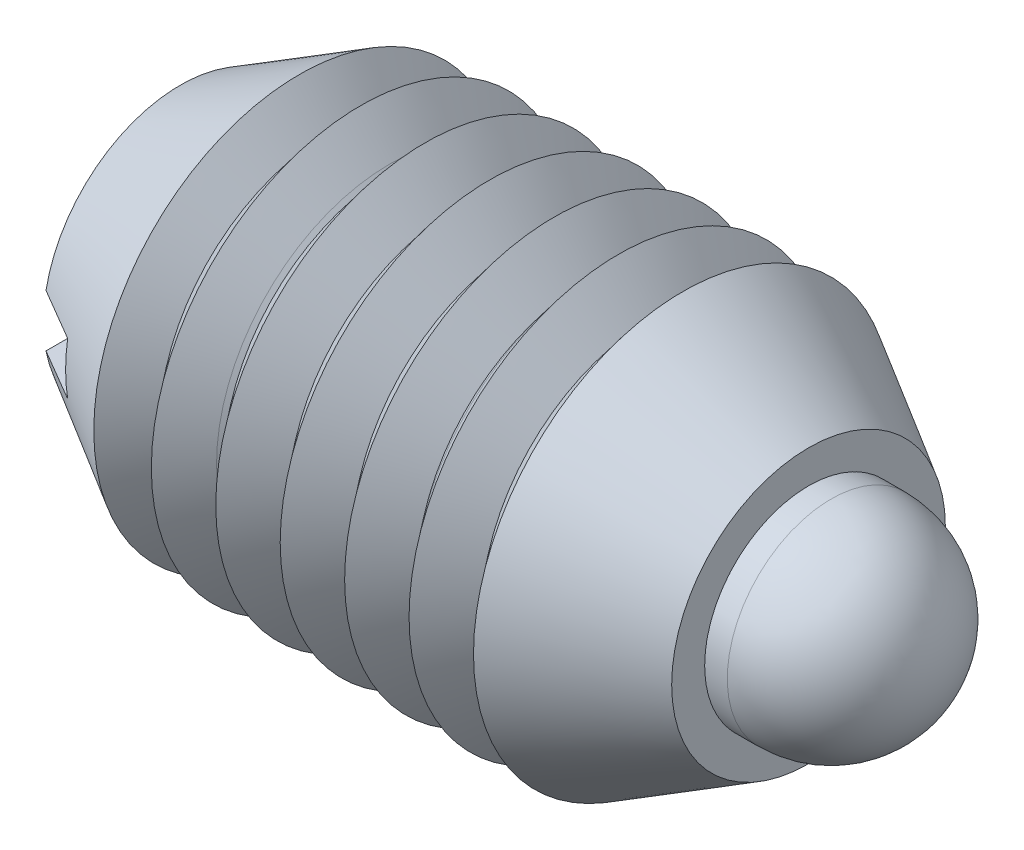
ISO-10303-21;
HEADER;
FILE_DESCRIPTION(('STEP AP214'),'2;1');
FILE_NAME('part.step','',(''),(''),'','','');
FILE_SCHEMA(('AUTOMOTIVE_DESIGN { 1 0 10303 214 1 1 1 1 }'));
ENDSEC;
DATA;
#1=APPLICATION_CONTEXT('core data for automotive mechanical design processes');
#2=APPLICATION_PROTOCOL_DEFINITION('international standard','automotive_design',2000,#1);
#3=PRODUCT_CONTEXT('',#1,'mechanical');
#4=PRODUCT('Part','Part','',(#3));
#5=PRODUCT_RELATED_PRODUCT_CATEGORY('part','',(#4));
#6=PRODUCT_DEFINITION_FORMATION('','',#4);
#7=PRODUCT_DEFINITION_CONTEXT('part definition',#1,'design');
#8=PRODUCT_DEFINITION('design','',#6,#7);
#9=PRODUCT_DEFINITION_SHAPE('','',#8);
#10=(LENGTH_UNIT() NAMED_UNIT(*) SI_UNIT(.MILLI.,.METRE.));
#11=(NAMED_UNIT(*) PLANE_ANGLE_UNIT() SI_UNIT($,.RADIAN.));
#12=(NAMED_UNIT(*) SI_UNIT($,.STERADIAN.) SOLID_ANGLE_UNIT());
#13=UNCERTAINTY_MEASURE_WITH_UNIT(LENGTH_MEASURE(1.E-05),#10,'distance_accuracy_value','');
#14=(GEOMETRIC_REPRESENTATION_CONTEXT(3) GLOBAL_UNCERTAINTY_ASSIGNED_CONTEXT((#13)) GLOBAL_UNIT_ASSIGNED_CONTEXT((#10,
#11,#12)) REPRESENTATION_CONTEXT('',''));
#15=CARTESIAN_POINT('',(0.,0.,0.));
#16=DIRECTION('',(0.,0.,1.));
#17=DIRECTION('',(1.,0.,0.));
#18=AXIS2_PLACEMENT_3D('',#15,#16,#17);
#19=CARTESIAN_POINT('',(11.80592,0.,0.));
#20=DIRECTION('',(-1.,0.,0.));
#21=DIRECTION('',(0.,-0.719424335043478,-0.694570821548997));
#22=AXIS2_PLACEMENT_3D('',#19,#20,#21);
#23=PLANE('',#22);
#24=CARTESIAN_POINT('',(11.80592,0.,0.));
#25=DIRECTION('',(1.,0.,0.));
#26=DIRECTION('',(0.,0.719424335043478,0.694570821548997));
#27=AXIS2_PLACEMENT_3D('',#24,#25,#26);
#28=CIRCLE('',#27,3.1496);
#29=CARTESIAN_POINT('',(11.80592,2.26589888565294,2.18762025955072));
#30=VERTEX_POINT('',#29);
#31=EDGE_CURVE('P0_E10',#30,#30,#28,.T.);
#32=ORIENTED_EDGE('',*,*,#31,.F.);
#33=EDGE_LOOP('',(#32));
#34=FACE_BOUND('',#33,.T.);
#35=ADVANCED_FACE('P0_F14',(#34),#23,.T.);
#36=CARTESIAN_POINT('',(12.43584,0.,0.));
#37=DIRECTION('',(1.,0.,0.));
#38=DIRECTION('',(0.,0.719424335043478,0.694570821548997));
#39=AXIS2_PLACEMENT_3D('',#36,#37,#38);
#40=CONICAL_SURFACE('',#39,3.77952,0.785398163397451);
#41=ORIENTED_EDGE('',*,*,#31,.T.);
#42=EDGE_LOOP('',(#41));
#43=FACE_BOUND('',#42,.T.);
#44=CARTESIAN_POINT('',(12.43584,0.,0.));
#45=DIRECTION('',(1.,0.,0.));
#46=DIRECTION('',(0.,0.719424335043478,0.694570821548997));
#47=AXIS2_PLACEMENT_3D('',#44,#45,#46);
#48=CIRCLE('',#47,3.77952);
#49=CARTESIAN_POINT('',(12.43584,2.71907866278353,2.62514431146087));
#50=VERTEX_POINT('',#49);
#51=EDGE_CURVE('P0_E20',#50,#50,#48,.T.);
#52=ORIENTED_EDGE('',*,*,#51,.F.);
#53=EDGE_LOOP('',(#52));
#54=FACE_BOUND('',#53,.T.);
#55=ADVANCED_FACE('P0_F54',(#43,#54),#40,.T.);
#56=CARTESIAN_POINT('',(22.8854,0.,0.));
#57=DIRECTION('',(1.,0.,0.));
#58=DIRECTION('',(0.,0.719424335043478,0.694570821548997));
#59=AXIS2_PLACEMENT_3D('',#56,#57,#58);
#60=CYLINDRICAL_SURFACE('',#59,3.77952);
#61=ORIENTED_EDGE('',*,*,#51,.T.);
#62=EDGE_LOOP('',(#61));
#63=FACE_BOUND('',#62,.T.);
#64=CARTESIAN_POINT('',(17.0140665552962,0.,0.));
#65=DIRECTION('',(1.,0.,0.));
#66=DIRECTION('',(0.,0.719424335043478,0.694570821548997));
#67=AXIS2_PLACEMENT_3D('',#64,#65,#66);
#68=CIRCLE('',#67,3.77952);
#69=CARTESIAN_POINT('',(17.0140665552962,2.71907866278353,2.62514431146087));
#70=VERTEX_POINT('',#69);
#71=EDGE_CURVE('P0_E24',#70,#70,#68,.T.);
#72=ORIENTED_EDGE('',*,*,#71,.F.);
#73=EDGE_LOOP('',(#72));
#74=FACE_BOUND('',#73,.T.);
#75=ADVANCED_FACE('P0_F50',(#63,#74),#60,.T.);
#76=CARTESIAN_POINT('',(18.10512,0.,0.));
#77=DIRECTION('',(-1.,0.,0.));
#78=DIRECTION('',(0.,-0.719424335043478,-0.694570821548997));
#79=AXIS2_PLACEMENT_3D('',#76,#77,#78);
#80=CONICAL_SURFACE('',#79,3.1496,0.523598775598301);
#81=ORIENTED_EDGE('',*,*,#71,.T.);
#82=EDGE_LOOP('',(#81));
#83=FACE_BOUND('',#82,.T.);
#84=CARTESIAN_POINT('',(18.10512,0.,0.));
#85=DIRECTION('',(1.,0.,0.));
#86=DIRECTION('',(0.,0.719424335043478,0.694570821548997));
#87=AXIS2_PLACEMENT_3D('',#84,#85,#86);
#88=CIRCLE('',#87,3.1496);
#89=CARTESIAN_POINT('',(18.10512,2.26589888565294,2.18762025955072));
#90=VERTEX_POINT('',#89);
#91=EDGE_CURVE('P0_E28',#90,#90,#88,.T.);
#92=ORIENTED_EDGE('',*,*,#91,.F.);
#93=EDGE_LOOP('',(#92));
#94=FACE_BOUND('',#93,.T.);
#95=ADVANCED_FACE('P0_F41',(#83,#94),#80,.T.);
#96=CARTESIAN_POINT('',(22.8854,0.,0.));
#97=DIRECTION('',(1.,0.,0.));
#98=DIRECTION('',(0.,0.719424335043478,0.694570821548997));
#99=AXIS2_PLACEMENT_3D('',#96,#97,#98);
#100=CYLINDRICAL_SURFACE('',#99,3.1496);
#101=ORIENTED_EDGE('',*,*,#91,.T.);
#102=EDGE_LOOP('',(#101));
#103=FACE_BOUND('',#102,.T.);
#104=CARTESIAN_POINT('',(19.7358,0.,0.));
#105=DIRECTION('',(1.,0.,0.));
#106=DIRECTION('',(0.,0.719424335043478,0.694570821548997));
#107=AXIS2_PLACEMENT_3D('',#104,#105,#106);
#108=CIRCLE('',#107,3.1496);
#109=CARTESIAN_POINT('',(19.7358,2.26589888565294,2.18762025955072));
#110=VERTEX_POINT('',#109);
#111=EDGE_CURVE('P0_E33',#110,#110,#108,.T.);
#112=ORIENTED_EDGE('',*,*,#111,.F.);
#113=EDGE_LOOP('',(#112));
#114=FACE_BOUND('',#113,.T.);
#115=ADVANCED_FACE('P0_F39',(#103,#114),#100,.T.);
#116=CARTESIAN_POINT('',(19.7358,0.,0.));
#117=DIRECTION('',(1.,0.,0.));
#118=DIRECTION('',(0.,0.719424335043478,0.694570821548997));
#119=AXIS2_PLACEMENT_3D('',#116,#117,#118);
#120=SPHERICAL_SURFACE('',#119,3.1496);
#121=ORIENTED_EDGE('',*,*,#111,.T.);
#122=EDGE_LOOP('',(#121));
#123=FACE_BOUND('',#122,.T.);
#124=ADVANCED_FACE('P0_F37',(#123),#120,.T.);
#125=CLOSED_SHELL('',(#35,#55,#75,#95,#115,#124));
#126=MANIFOLD_SOLID_BREP('P0_B1',#125);
#127=CARTESIAN_POINT('',(6.35,12.7,-6.35));
#128=DIRECTION('',(-1.,0.,0.));
#129=DIRECTION('',(0.,-1.,0.));
#130=AXIS2_PLACEMENT_3D('',#127,#128,#129);
#131=PLANE('',#130);
#132=CARTESIAN_POINT('',(6.35,0.,0.));
#133=DIRECTION('',(-1.,0.,0.));
#134=DIRECTION('',(0.,-1.,0.));
#135=AXIS2_PLACEMENT_3D('',#132,#133,#134);
#136=CIRCLE('',#135,5.25184112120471);
#137=CARTESIAN_POINT('',(6.35,-5.25184112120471,0.));
#138=VERTEX_POINT('',#137);
#139=EDGE_CURVE('P1_E31',#138,#138,#136,.F.);
#140=ORIENTED_EDGE('',*,*,#139,.F.);
#141=EDGE_LOOP('',(#140));
#142=FACE_BOUND('',#141,.T.);
#143=CARTESIAN_POINT('',(6.35,0.,0.));
#144=DIRECTION('',(1.,0.,0.));
#145=DIRECTION('',(0.,0.,-1.));
#146=AXIS2_PLACEMENT_3D('',#143,#144,#145);
#147=CIRCLE('',#146,3.80492);
#148=CARTESIAN_POINT('',(6.35,0.,3.80492));
#149=VERTEX_POINT('',#148);
#150=EDGE_CURVE('P1_E47',#149,#149,#147,.T.);
#151=ORIENTED_EDGE('',*,*,#150,.T.);
#152=EDGE_LOOP('',(#151));
#153=FACE_BOUND('',#152,.T.);
#154=ADVANCED_FACE('P1_F14',(#142,#153),#131,.T.);
#155=CARTESIAN_POINT('',(12.7,12.7,-6.35));
#156=DIRECTION('',(1.,0.,0.));
#157=DIRECTION('',(0.,0.,-1.));
#158=AXIS2_PLACEMENT_3D('',#155,#156,#157);
#159=PLANE('',#158);
#160=CARTESIAN_POINT('',(12.7,0.,0.));
#161=DIRECTION('',(1.,0.,0.));
#162=DIRECTION('',(0.,0.,-1.));
#163=AXIS2_PLACEMENT_3D('',#160,#161,#162);
#164=CIRCLE('',#163,5.61789408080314);
#165=CARTESIAN_POINT('',(12.7,0.,-5.61789408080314));
#166=VERTEX_POINT('',#165);
#167=EDGE_CURVE('P1_E33',#166,#166,#164,.F.);
#168=ORIENTED_EDGE('',*,*,#167,.F.);
#169=EDGE_LOOP('',(#168));
#170=FACE_BOUND('',#169,.T.);
#171=CARTESIAN_POINT('',(12.7,0.,0.));
#172=DIRECTION('',(1.,0.,0.));
#173=DIRECTION('',(0.,0.,-1.));
#174=AXIS2_PLACEMENT_3D('',#171,#172,#173);
#175=CIRCLE('',#174,3.80492);
#176=CARTESIAN_POINT('',(12.7,0.,3.80492));
#177=VERTEX_POINT('',#176);
#178=EDGE_CURVE('P1_E18',#177,#177,#175,.F.);
#179=ORIENTED_EDGE('',*,*,#178,.T.);
#180=EDGE_LOOP('',(#179));
#181=FACE_BOUND('',#180,.T.);
#182=ADVANCED_FACE('P1_F71',(#170,#181),#159,.T.);
#183=CARTESIAN_POINT('',(8.40153846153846,0.,0.));
#184=DIRECTION('',(1.,0.,0.));
#185=DIRECTION('',(0.,0.,-1.));
#186=AXIS2_PLACEMENT_3D('',#183,#184,#185);
#187=CONICAL_SURFACE('',#186,5.12982346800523,0.895664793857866);
#188=CARTESIAN_POINT('',(9.37846153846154,0.,0.));
#189=DIRECTION('',(-1.,0.,0.));
#190=DIRECTION('',(0.,0.,1.));
#191=AXIS2_PLACEMENT_3D('',#188,#189,#190);
#192=CIRCLE('',#191,6.35);
#193=CARTESIAN_POINT('',(9.37846153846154,0.,6.35));
#194=VERTEX_POINT('',#193);
#195=EDGE_CURVE('P1_E44',#194,#194,#192,.T.);
#196=ORIENTED_EDGE('',*,*,#195,.T.);
#197=EDGE_LOOP('',(#196));
#198=FACE_BOUND('',#197,.T.);
#199=CARTESIAN_POINT('',(8.40153846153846,0.,0.));
#200=DIRECTION('',(-1.,0.,0.));
#201=DIRECTION('',(0.,0.,1.));
#202=AXIS2_PLACEMENT_3D('',#199,#200,#201);
#203=CIRCLE('',#202,5.12982346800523);
#204=CARTESIAN_POINT('',(8.40153846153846,0.,5.12982346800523));
#205=VERTEX_POINT('',#204);
#206=EDGE_CURVE('P1_E51',#205,#205,#203,.T.);
#207=ORIENTED_EDGE('',*,*,#206,.F.);
#208=EDGE_LOOP('',(#207));
#209=FACE_BOUND('',#208,.T.);
#210=ADVANCED_FACE('P1_F77',(#198,#209),#187,.T.);
#211=CARTESIAN_POINT('',(7.42461538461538,0.,0.));
#212=DIRECTION('',(-1.,0.,0.));
#213=DIRECTION('',(0.,0.,1.));
#214=AXIS2_PLACEMENT_3D('',#211,#212,#213);
#215=CONICAL_SURFACE('',#214,6.35,0.895664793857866);
#216=ORIENTED_EDGE('',*,*,#206,.T.);
#217=EDGE_LOOP('',(#216));
#218=FACE_BOUND('',#217,.T.);
#219=CARTESIAN_POINT('',(7.42461538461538,0.,0.));
#220=DIRECTION('',(-1.,0.,0.));
#221=DIRECTION('',(0.,0.,1.));
#222=AXIS2_PLACEMENT_3D('',#219,#220,#221);
#223=CIRCLE('',#222,6.35);
#224=CARTESIAN_POINT('',(7.42461538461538,0.,6.35));
#225=VERTEX_POINT('',#224);
#226=EDGE_CURVE('P1_E35',#225,#225,#223,.T.);
#227=ORIENTED_EDGE('',*,*,#226,.F.);
#228=EDGE_LOOP('',(#227));
#229=FACE_BOUND('',#228,.T.);
#230=ADVANCED_FACE('P1_F91',(#218,#229),#215,.T.);
#231=CARTESIAN_POINT('',(6.44769230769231,0.,0.));
#232=DIRECTION('',(1.,0.,0.));
#233=DIRECTION('',(0.,0.,-1.));
#234=AXIS2_PLACEMENT_3D('',#231,#232,#233);
#235=CONICAL_SURFACE('',#234,5.12982346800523,0.895664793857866);
#236=ORIENTED_EDGE('',*,*,#226,.T.);
#237=EDGE_LOOP('',(#236));
#238=FACE_BOUND('',#237,.T.);
#239=CARTESIAN_POINT('',(6.44769230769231,0.,0.));
#240=DIRECTION('',(-1.,0.,0.));
#241=DIRECTION('',(0.,0.,1.));
#242=AXIS2_PLACEMENT_3D('',#239,#240,#241);
#243=CIRCLE('',#242,5.12982346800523);
#244=CARTESIAN_POINT('',(6.44769230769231,0.,5.12982346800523));
#245=VERTEX_POINT('',#244);
#246=EDGE_CURVE('P1_E39',#245,#245,#243,.T.);
#247=ORIENTED_EDGE('',*,*,#246,.F.);
#248=EDGE_LOOP('',(#247));
#249=FACE_BOUND('',#248,.T.);
#250=ADVANCED_FACE('P1_F87',(#238,#249),#235,.T.);
#251=CARTESIAN_POINT('',(5.47076923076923,0.,0.));
#252=DIRECTION('',(-1.,0.,0.));
#253=DIRECTION('',(0.,0.,1.));
#254=AXIS2_PLACEMENT_3D('',#251,#252,#253);
#255=CONICAL_SURFACE('',#254,6.35,0.895664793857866);
#256=ORIENTED_EDGE('',*,*,#246,.T.);
#257=EDGE_LOOP('',(#256));
#258=FACE_BOUND('',#257,.T.);
#259=ORIENTED_EDGE('',*,*,#139,.T.);
#260=EDGE_LOOP('',(#259));
#261=FACE_BOUND('',#260,.T.);
#262=ADVANCED_FACE('P1_F84',(#258,#261),#255,.T.);
#263=CARTESIAN_POINT('',(9.37846153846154,0.,0.));
#264=DIRECTION('',(-1.,0.,0.));
#265=DIRECTION('',(0.,0.,1.));
#266=AXIS2_PLACEMENT_3D('',#263,#264,#265);
#267=CONICAL_SURFACE('',#266,6.35,0.895664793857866);
#268=CARTESIAN_POINT('',(10.3553846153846,0.,0.));
#269=DIRECTION('',(-1.,0.,0.));
#270=DIRECTION('',(0.,0.,1.));
#271=AXIS2_PLACEMENT_3D('',#268,#269,#270);
#272=CIRCLE('',#271,5.12982346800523);
#273=CARTESIAN_POINT('',(10.3553846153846,0.,5.12982346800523));
#274=VERTEX_POINT('',#273);
#275=EDGE_CURVE('P1_E22',#274,#274,#272,.T.);
#276=ORIENTED_EDGE('',*,*,#275,.T.);
#277=EDGE_LOOP('',(#276));
#278=FACE_BOUND('',#277,.T.);
#279=ORIENTED_EDGE('',*,*,#195,.F.);
#280=EDGE_LOOP('',(#279));
#281=FACE_BOUND('',#280,.T.);
#282=ADVANCED_FACE('P1_F68',(#278,#281),#267,.T.);
#283=CARTESIAN_POINT('',(10.3553846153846,0.,0.));
#284=DIRECTION('',(1.,0.,0.));
#285=DIRECTION('',(0.,0.,-1.));
#286=AXIS2_PLACEMENT_3D('',#283,#284,#285);
#287=CONICAL_SURFACE('',#286,5.12982346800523,0.895664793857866);
#288=CARTESIAN_POINT('',(11.3323076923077,0.,0.));
#289=DIRECTION('',(-1.,0.,0.));
#290=DIRECTION('',(0.,0.,1.));
#291=AXIS2_PLACEMENT_3D('',#288,#289,#290);
#292=CIRCLE('',#291,6.35);
#293=CARTESIAN_POINT('',(11.3323076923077,0.,6.35));
#294=VERTEX_POINT('',#293);
#295=EDGE_CURVE('P1_E27',#294,#294,#292,.T.);
#296=ORIENTED_EDGE('',*,*,#295,.T.);
#297=EDGE_LOOP('',(#296));
#298=FACE_BOUND('',#297,.T.);
#299=ORIENTED_EDGE('',*,*,#275,.F.);
#300=EDGE_LOOP('',(#299));
#301=FACE_BOUND('',#300,.T.);
#302=ADVANCED_FACE('P1_F56',(#298,#301),#287,.T.);
#303=CARTESIAN_POINT('',(11.3323076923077,0.,0.));
#304=DIRECTION('',(-1.,0.,0.));
#305=DIRECTION('',(0.,0.,1.));
#306=AXIS2_PLACEMENT_3D('',#303,#304,#305);
#307=CONICAL_SURFACE('',#306,6.35,0.895664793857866);
#308=CARTESIAN_POINT('',(12.3092307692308,0.,0.));
#309=DIRECTION('',(-1.,0.,0.));
#310=DIRECTION('',(0.,0.,1.));
#311=AXIS2_PLACEMENT_3D('',#308,#309,#310);
#312=CIRCLE('',#311,5.12982346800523);
#313=CARTESIAN_POINT('',(12.3092307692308,0.,5.12982346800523));
#314=VERTEX_POINT('',#313);
#315=EDGE_CURVE('P1_E10',#314,#314,#312,.T.);
#316=ORIENTED_EDGE('',*,*,#315,.T.);
#317=EDGE_LOOP('',(#316));
#318=FACE_BOUND('',#317,.T.);
#319=ORIENTED_EDGE('',*,*,#295,.F.);
#320=EDGE_LOOP('',(#319));
#321=FACE_BOUND('',#320,.T.);
#322=ADVANCED_FACE('P1_F59',(#318,#321),#307,.T.);
#323=CARTESIAN_POINT('',(12.3092307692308,0.,0.));
#324=DIRECTION('',(1.,0.,0.));
#325=DIRECTION('',(0.,0.,-1.));
#326=AXIS2_PLACEMENT_3D('',#323,#324,#325);
#327=CONICAL_SURFACE('',#326,5.12982346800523,0.895664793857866);
#328=ORIENTED_EDGE('',*,*,#315,.F.);
#329=EDGE_LOOP('',(#328));
#330=FACE_BOUND('',#329,.T.);
#331=ORIENTED_EDGE('',*,*,#167,.T.);
#332=EDGE_LOOP('',(#331));
#333=FACE_BOUND('',#332,.T.);
#334=ADVANCED_FACE('P1_F16',(#330,#333),#327,.T.);
#335=CARTESIAN_POINT('',(19.05,0.,0.));
#336=DIRECTION('',(-1.,0.,0.));
#337=DIRECTION('',(0.,0.,1.));
#338=AXIS2_PLACEMENT_3D('',#335,#336,#337);
#339=CYLINDRICAL_SURFACE('',#338,3.80492);
#340=CARTESIAN_POINT('',(12.7,0.,3.80492));
#341=CARTESIAN_POINT('',(12.6338541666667,0.,3.80492));
#342=CARTESIAN_POINT('',(12.5677083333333,0.,3.80492));
#343=CARTESIAN_POINT('',(12.4354166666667,0.,3.80492));
#344=CARTESIAN_POINT('',(12.3692708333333,0.,3.80492));
#345=CARTESIAN_POINT('',(12.2369791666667,0.,3.80492));
#346=CARTESIAN_POINT('',(12.1708333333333,0.,3.80492));
#347=CARTESIAN_POINT('',(12.0385416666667,0.,3.80492));
#348=CARTESIAN_POINT('',(11.9723958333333,0.,3.80492));
#349=CARTESIAN_POINT('',(11.8401041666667,0.,3.80492));
#350=CARTESIAN_POINT('',(11.7739583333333,0.,3.80492));
#351=CARTESIAN_POINT('',(11.6416666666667,0.,3.80492));
#352=CARTESIAN_POINT('',(11.5755208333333,0.,3.80492));
#353=CARTESIAN_POINT('',(11.4432291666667,0.,3.80492));
#354=CARTESIAN_POINT('',(11.3770833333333,0.,3.80492));
#355=CARTESIAN_POINT('',(11.2447916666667,0.,3.80492));
#356=CARTESIAN_POINT('',(11.1786458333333,0.,3.80492));
#357=CARTESIAN_POINT('',(11.0463541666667,0.,3.80492));
#358=CARTESIAN_POINT('',(10.9802083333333,0.,3.80492));
#359=CARTESIAN_POINT('',(10.8479166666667,0.,3.80492));
#360=CARTESIAN_POINT('',(10.7817708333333,0.,3.80492));
#361=CARTESIAN_POINT('',(10.6494791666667,0.,3.80492));
#362=CARTESIAN_POINT('',(10.5833333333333,0.,3.80492));
#363=CARTESIAN_POINT('',(10.4510416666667,0.,3.80492));
#364=CARTESIAN_POINT('',(10.3848958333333,0.,3.80492));
#365=CARTESIAN_POINT('',(10.2526041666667,0.,3.80492));
#366=CARTESIAN_POINT('',(10.1864583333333,0.,3.80492));
#367=CARTESIAN_POINT('',(10.0541666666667,0.,3.80492));
#368=CARTESIAN_POINT('',(9.98802083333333,0.,3.80492));
#369=CARTESIAN_POINT('',(9.85572916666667,0.,3.80492));
#370=CARTESIAN_POINT('',(9.78958333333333,0.,3.80492));
#371=CARTESIAN_POINT('',(9.65729166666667,0.,3.80492));
#372=CARTESIAN_POINT('',(9.59114583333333,0.,3.80492));
#373=CARTESIAN_POINT('',(9.45885416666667,0.,3.80492));
#374=CARTESIAN_POINT('',(9.39270833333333,0.,3.80492));
#375=CARTESIAN_POINT('',(9.26041666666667,0.,3.80492));
#376=CARTESIAN_POINT('',(9.19427083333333,0.,3.80492));
#377=CARTESIAN_POINT('',(9.06197916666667,0.,3.80492));
#378=CARTESIAN_POINT('',(8.99583333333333,0.,3.80492));
#379=CARTESIAN_POINT('',(8.86354166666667,0.,3.80492));
#380=CARTESIAN_POINT('',(8.79739583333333,0.,3.80492));
#381=CARTESIAN_POINT('',(8.66510416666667,0.,3.80492));
#382=CARTESIAN_POINT('',(8.59895833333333,0.,3.80492));
#383=CARTESIAN_POINT('',(8.46666666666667,0.,3.80492));
#384=CARTESIAN_POINT('',(8.40052083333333,0.,3.80492));
#385=CARTESIAN_POINT('',(8.26822916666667,0.,3.80492));
#386=CARTESIAN_POINT('',(8.20208333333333,0.,3.80492));
#387=CARTESIAN_POINT('',(8.06979166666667,0.,3.80492));
#388=CARTESIAN_POINT('',(8.00364583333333,0.,3.80492));
#389=CARTESIAN_POINT('',(7.87135416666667,0.,3.80492));
#390=CARTESIAN_POINT('',(7.80520833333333,0.,3.80492));
#391=CARTESIAN_POINT('',(7.67291666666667,0.,3.80492));
#392=CARTESIAN_POINT('',(7.60677083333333,0.,3.80492));
#393=CARTESIAN_POINT('',(7.47447916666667,0.,3.80492));
#394=CARTESIAN_POINT('',(7.40833333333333,0.,3.80492));
#395=CARTESIAN_POINT('',(7.27604166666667,0.,3.80492));
#396=CARTESIAN_POINT('',(7.20989583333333,0.,3.80492));
#397=CARTESIAN_POINT('',(7.07760416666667,0.,3.80492));
#398=CARTESIAN_POINT('',(7.01145833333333,0.,3.80492));
#399=CARTESIAN_POINT('',(6.87916666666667,0.,3.80492));
#400=CARTESIAN_POINT('',(6.81302083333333,0.,3.80492));
#401=CARTESIAN_POINT('',(6.68072916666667,0.,3.80492));
#402=CARTESIAN_POINT('',(6.61458333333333,0.,3.80492));
#403=CARTESIAN_POINT('',(6.48229166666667,0.,3.80492));
#404=CARTESIAN_POINT('',(6.41614583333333,0.,3.80492));
#405=CARTESIAN_POINT('',(6.35,0.,3.80492));
#406=B_SPLINE_CURVE_WITH_KNOTS('',3,(#340,#341,#342,#343,#344,#345,#346,#347,#348,#349,#350,
#351,#352,#353,#354,#355,#356,#357,#358,#359,#360,#361,#362,#363,#364,#365,#366,#367,#368,#369,
#370,#371,#372,#373,#374,#375,#376,#377,#378,#379,#380,#381,#382,#383,#384,#385,#386,#387,#388,
#389,#390,#391,#392,#393,#394,#395,#396,#397,#398,#399,#400,#401,#402,#403,#404,#405),
.UNSPECIFIED.,.F.,.F.,(4,2,2,2,2,2,2,2,2,2,2,2,2,2,2,2,2,2,2,2,2,2,2,2,2,2,2,2,2,2,2,2,4),(0.,
0.198437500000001,0.396875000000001,0.5953125,0.793750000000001,0.992187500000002,1.190625,
1.3890625,1.5875,1.7859375,1.984375,2.1828125,2.38125,2.5796875,2.778125,2.9765625,3.175,
3.3734375,3.571875,3.7703125,3.96875,4.1671875,4.365625,4.5640625,4.7625,4.9609375,5.159375,
5.3578125,5.55625,5.7546875,5.953125,6.1515625,6.35),.UNSPECIFIED.);
#407=EDGE_CURVE('P1_BSEAM66',#177,#149,#406,.T.);
#408=ORIENTED_EDGE('',*,*,#178,.F.);
#409=ORIENTED_EDGE('',*,*,#150,.F.);
#410=ORIENTED_EDGE('',*,*,#407,.T.);
#411=ORIENTED_EDGE('',*,*,#407,.F.);
#412=EDGE_LOOP('',(#408,#410,#409,#411));
#413=FACE_BOUND('',#412,.T.);
#414=ADVANCED_FACE('P1_F66',(#413),#339,.F.);
#415=CLOSED_SHELL('',(#154,#182,#210,#230,#250,#262,#282,#302,#322,#334,#414));
#416=MANIFOLD_SOLID_BREP('P1_B1',#415);
#417=CARTESIAN_POINT('',(19.05,0.,0.));
#418=DIRECTION('',(1.,0.,0.));
#419=DIRECTION('',(0.,0.,-1.));
#420=AXIS2_PLACEMENT_3D('',#417,#418,#419);
#421=PLANE('',#420);
#422=CARTESIAN_POINT('',(19.05,0.,0.));
#423=DIRECTION('',(1.,0.,0.));
#424=DIRECTION('',(0.,0.,-1.));
#425=AXIS2_PLACEMENT_3D('',#422,#423,#424);
#426=CIRCLE('',#425,4.15029547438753);
#427=CARTESIAN_POINT('',(19.05,0.,-4.15029547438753));
#428=VERTEX_POINT('',#427);
#429=EDGE_CURVE('P2_E79',#428,#428,#426,.T.);
#430=ORIENTED_EDGE('',*,*,#429,.T.);
#431=EDGE_LOOP('',(#430));
#432=FACE_BOUND('',#431,.T.);
#433=CARTESIAN_POINT('',(19.05,0.,0.));
#434=DIRECTION('',(-1.,0.,0.));
#435=DIRECTION('',(0.,0.,1.));
#436=AXIS2_PLACEMENT_3D('',#433,#434,#435);
#437=CIRCLE('',#436,3.1496);
#438=CARTESIAN_POINT('',(19.05,0.,3.1496));
#439=VERTEX_POINT('',#438);
#440=EDGE_CURVE('P2_E66',#439,#439,#437,.T.);
#441=ORIENTED_EDGE('',*,*,#440,.T.);
#442=EDGE_LOOP('',(#441));
#443=FACE_BOUND('',#442,.T.);
#444=ADVANCED_FACE('P2_F15',(#432,#443),#421,.T.);
#445=CARTESIAN_POINT('',(19.05,0.,0.));
#446=DIRECTION('',(-1.,0.,0.));
#447=DIRECTION('',(0.,0.,1.));
#448=AXIS2_PLACEMENT_3D('',#445,#446,#447);
#449=CONICAL_SURFACE('',#448,4.15029547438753,0.523598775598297);
#450=CARTESIAN_POINT('',(15.24,0.,0.));
#451=DIRECTION('',(-1.,0.,0.));
#452=DIRECTION('',(0.,0.,1.));
#453=AXIS2_PLACEMENT_3D('',#450,#451,#452);
#454=CIRCLE('',#453,6.35);
#455=CARTESIAN_POINT('',(15.24,0.,6.35));
#456=VERTEX_POINT('',#455);
#457=EDGE_CURVE('P2_E135',#456,#456,#454,.T.);
#458=ORIENTED_EDGE('',*,*,#457,.F.);
#459=EDGE_LOOP('',(#458));
#460=FACE_BOUND('',#459,.T.);
#461=ORIENTED_EDGE('',*,*,#429,.F.);
#462=EDGE_LOOP('',(#461));
#463=FACE_BOUND('',#462,.T.);
#464=ADVANCED_FACE('P2_F17',(#460,#463),#449,.T.);
#465=CARTESIAN_POINT('',(0.,0.,0.));
#466=DIRECTION('',(-1.,0.,0.));
#467=DIRECTION('',(0.,0.,1.));
#468=AXIS2_PLACEMENT_3D('',#465,#466,#467);
#469=CYLINDRICAL_SURFACE('',#468,3.1496);
#470=CARTESIAN_POINT('',(18.10512,0.,0.));
#471=DIRECTION('',(-1.,0.,0.));
#472=DIRECTION('',(0.,0.,1.));
#473=AXIS2_PLACEMENT_3D('',#470,#471,#472);
#474=CIRCLE('',#473,3.1496);
#475=CARTESIAN_POINT('',(18.10512,0.,3.1496));
#476=VERTEX_POINT('',#475);
#477=EDGE_CURVE('P2_E147',#476,#476,#474,.T.);
#478=ORIENTED_EDGE('',*,*,#477,.T.);
#479=EDGE_LOOP('',(#478));
#480=FACE_BOUND('',#479,.T.);
#481=ORIENTED_EDGE('',*,*,#440,.F.);
#482=EDGE_LOOP('',(#481));
#483=FACE_BOUND('',#482,.T.);
#484=ADVANCED_FACE('P2_F170',(#480,#483),#469,.F.);
#485=CARTESIAN_POINT('',(18.10512,0.,0.));
#486=DIRECTION('',(-1.,0.,0.));
#487=DIRECTION('',(0.,0.,1.));
#488=AXIS2_PLACEMENT_3D('',#485,#486,#487);
#489=CONICAL_SURFACE('',#488,3.1496,0.785398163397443);
#490=CARTESIAN_POINT('',(17.4752,0.,0.));
#491=DIRECTION('',(-1.,0.,0.));
#492=DIRECTION('',(0.,0.,1.));
#493=AXIS2_PLACEMENT_3D('',#490,#491,#492);
#494=CIRCLE('',#493,3.77952);
#495=CARTESIAN_POINT('',(17.4752,0.,3.77952));
#496=VERTEX_POINT('',#495);
#497=EDGE_CURVE('P2_E144',#496,#496,#494,.T.);
#498=ORIENTED_EDGE('',*,*,#497,.T.);
#499=EDGE_LOOP('',(#498));
#500=FACE_BOUND('',#499,.T.);
#501=ORIENTED_EDGE('',*,*,#477,.F.);
#502=EDGE_LOOP('',(#501));
#503=FACE_BOUND('',#502,.T.);
#504=ADVANCED_FACE('P2_F177',(#500,#503),#489,.F.);
#505=CARTESIAN_POINT('',(0.,0.,0.));
#506=DIRECTION('',(-1.,0.,0.));
#507=DIRECTION('',(0.,0.,1.));
#508=AXIS2_PLACEMENT_3D('',#505,#506,#507);
#509=CYLINDRICAL_SURFACE('',#508,3.77952);
#510=CARTESIAN_POINT('',(4.7625,0.,0.));
#511=DIRECTION('',(-1.,0.,0.));
#512=DIRECTION('',(0.,0.,1.));
#513=AXIS2_PLACEMENT_3D('',#510,#511,#512);
#514=CIRCLE('',#513,3.77952);
#515=CARTESIAN_POINT('',(4.7625,0.,3.77952));
#516=VERTEX_POINT('',#515);
#517=EDGE_CURVE('P2_E141',#516,#516,#514,.T.);
#518=ORIENTED_EDGE('',*,*,#517,.T.);
#519=EDGE_LOOP('',(#518));
#520=FACE_BOUND('',#519,.T.);
#521=ORIENTED_EDGE('',*,*,#497,.F.);
#522=EDGE_LOOP('',(#521));
#523=FACE_BOUND('',#522,.T.);
#524=ADVANCED_FACE('P2_F182',(#520,#523),#509,.F.);
#525=CARTESIAN_POINT('',(4.7625,0.,0.));
#526=DIRECTION('',(1.,0.,0.));
#527=DIRECTION('',(0.,0.,-1.));
#528=AXIS2_PLACEMENT_3D('',#525,#526,#527);
#529=PLANE('',#528);
#530=ORIENTED_EDGE('',*,*,#517,.F.);
#531=EDGE_LOOP('',(#530));
#532=FACE_BOUND('',#531,.T.);
#533=ADVANCED_FACE('P2_F188',(#532),#529,.T.);
#534=CARTESIAN_POINT('',(14.2630769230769,0.,0.));
#535=DIRECTION('',(1.,0.,0.));
#536=DIRECTION('',(0.,0.,-1.));
#537=AXIS2_PLACEMENT_3D('',#534,#535,#536);
#538=CONICAL_SURFACE('',#537,5.12982346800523,0.895664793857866);
#539=ORIENTED_EDGE('',*,*,#457,.T.);
#540=EDGE_LOOP('',(#539));
#541=FACE_BOUND('',#540,.T.);
#542=CARTESIAN_POINT('',(14.2630769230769,0.,0.));
#543=DIRECTION('',(-1.,0.,0.));
#544=DIRECTION('',(0.,0.,1.));
#545=AXIS2_PLACEMENT_3D('',#542,#543,#544);
#546=CIRCLE('',#545,5.12982346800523);
#547=CARTESIAN_POINT('',(14.2630769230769,0.,5.12982346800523));
#548=VERTEX_POINT('',#547);
#549=EDGE_CURVE('P2_E138',#548,#548,#546,.T.);
#550=ORIENTED_EDGE('',*,*,#549,.F.);
#551=EDGE_LOOP('',(#550));
#552=FACE_BOUND('',#551,.T.);
#553=ADVANCED_FACE('P2_F192',(#541,#552),#538,.T.);
#554=CARTESIAN_POINT('',(13.2861538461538,0.,0.));
#555=DIRECTION('',(-1.,0.,0.));
#556=DIRECTION('',(0.,0.,1.));
#557=AXIS2_PLACEMENT_3D('',#554,#555,#556);
#558=CONICAL_SURFACE('',#557,6.35,0.895664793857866);
#559=ORIENTED_EDGE('',*,*,#549,.T.);
#560=EDGE_LOOP('',(#559));
#561=FACE_BOUND('',#560,.T.);
#562=CARTESIAN_POINT('',(13.2861538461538,0.,0.));
#563=DIRECTION('',(-1.,0.,0.));
#564=DIRECTION('',(0.,0.,1.));
#565=AXIS2_PLACEMENT_3D('',#562,#563,#564);
#566=CIRCLE('',#565,6.35);
#567=CARTESIAN_POINT('',(13.2861538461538,0.,6.35));
#568=VERTEX_POINT('',#567);
#569=EDGE_CURVE('P2_E112',#568,#568,#566,.T.);
#570=ORIENTED_EDGE('',*,*,#569,.F.);
#571=EDGE_LOOP('',(#570));
#572=FACE_BOUND('',#571,.T.);
#573=ADVANCED_FACE('P2_F196',(#561,#572),#558,.T.);
#574=CARTESIAN_POINT('',(12.3092307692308,0.,0.));
#575=DIRECTION('',(1.,0.,0.));
#576=DIRECTION('',(0.,0.,-1.));
#577=AXIS2_PLACEMENT_3D('',#574,#575,#576);
#578=CONICAL_SURFACE('',#577,5.12982346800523,0.895664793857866);
#579=CARTESIAN_POINT('',(12.7,0.,0.));
#580=DIRECTION('',(1.,0.,0.));
#581=DIRECTION('',(0.,0.,-1.));
#582=AXIS2_PLACEMENT_3D('',#579,#580,#581);
#583=CIRCLE('',#582,5.61789408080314);
#584=CARTESIAN_POINT('',(12.7,0.,-5.61789408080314));
#585=VERTEX_POINT('',#584);
#586=EDGE_CURVE('P2_E19',#585,#585,#583,.F.);
#587=ORIENTED_EDGE('',*,*,#586,.F.);
#588=EDGE_LOOP('',(#587));
#589=FACE_BOUND('',#588,.T.);
#590=ORIENTED_EDGE('',*,*,#569,.T.);
#591=EDGE_LOOP('',(#590));
#592=FACE_BOUND('',#591,.T.);
#593=ADVANCED_FACE('P2_F200',(#589,#592),#578,.T.);
#594=CARTESIAN_POINT('',(6.35,0.,0.));
#595=DIRECTION('',(1.,0.,0.));
#596=DIRECTION('',(0.,0.,-1.));
#597=AXIS2_PLACEMENT_3D('',#594,#595,#596);
#598=PLANE('',#597);
#599=CARTESIAN_POINT('',(6.35,0.,0.));
#600=DIRECTION('',(1.,0.,0.));
#601=DIRECTION('',(0.,0.,-1.));
#602=AXIS2_PLACEMENT_3D('',#599,#600,#601);
#603=CIRCLE('',#602,5.25184112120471);
#604=CARTESIAN_POINT('',(6.35,0.,-5.25184112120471));
#605=VERTEX_POINT('',#604);
#606=EDGE_CURVE('P2_E114',#605,#605,#603,.F.);
#607=ORIENTED_EDGE('',*,*,#606,.F.);
#608=EDGE_LOOP('',(#607));
#609=FACE_BOUND('',#608,.T.);
#610=CARTESIAN_POINT('',(6.35,0.,0.));
#611=DIRECTION('',(1.,0.,0.));
#612=DIRECTION('',(0.,0.,-1.));
#613=AXIS2_PLACEMENT_3D('',#610,#611,#612);
#614=CIRCLE('',#613,3.80492);
#615=CARTESIAN_POINT('',(6.35,0.,-3.80492));
#616=VERTEX_POINT('',#615);
#617=EDGE_CURVE('P2_E116',#616,#616,#614,.T.);
#618=ORIENTED_EDGE('',*,*,#617,.F.);
#619=EDGE_LOOP('',(#618));
#620=FACE_BOUND('',#619,.T.);
#621=ADVANCED_FACE('P2_F204',(#609,#620),#598,.T.);
#622=CARTESIAN_POINT('',(30.8401173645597,0.,0.));
#623=DIRECTION('',(-1.,0.,0.));
#624=DIRECTION('',(0.,0.,1.));
#625=AXIS2_PLACEMENT_3D('',#622,#623,#624);
#626=CYLINDRICAL_SURFACE('',#625,3.80492);
#627=ORIENTED_EDGE('',*,*,#617,.T.);
#628=EDGE_LOOP('',(#627));
#629=FACE_BOUND('',#628,.T.);
#630=CARTESIAN_POINT('',(12.7,0.,0.));
#631=DIRECTION('',(1.,0.,0.));
#632=DIRECTION('',(0.,0.,-1.));
#633=AXIS2_PLACEMENT_3D('',#630,#631,#632);
#634=CIRCLE('',#633,3.80492);
#635=CARTESIAN_POINT('',(12.7,0.,-3.80492));
#636=VERTEX_POINT('',#635);
#637=EDGE_CURVE('P2_E122',#636,#636,#634,.T.);
#638=ORIENTED_EDGE('',*,*,#637,.F.);
#639=EDGE_LOOP('',(#638));
#640=FACE_BOUND('',#639,.T.);
#641=ADVANCED_FACE('P2_F161',(#629,#640),#626,.T.);
#642=CARTESIAN_POINT('',(12.7,0.,0.));
#643=DIRECTION('',(1.,0.,0.));
#644=DIRECTION('',(0.,0.,-1.));
#645=AXIS2_PLACEMENT_3D('',#642,#643,#644);
#646=PLANE('',#645);
#647=ORIENTED_EDGE('',*,*,#586,.T.);
#648=EDGE_LOOP('',(#647));
#649=FACE_BOUND('',#648,.T.);
#650=ORIENTED_EDGE('',*,*,#637,.T.);
#651=EDGE_LOOP('',(#650));
#652=FACE_BOUND('',#651,.T.);
#653=ADVANCED_FACE('P2_F156',(#649,#652),#646,.F.);
#654=CARTESIAN_POINT('',(0.,0.,0.));
#655=DIRECTION('',(1.,0.,0.));
#656=DIRECTION('',(0.,0.,-1.));
#657=AXIS2_PLACEMENT_3D('',#654,#655,#656);
#658=PLANE('',#657);
#659=CARTESIAN_POINT('',(0.,0.,0.));
#660=DIRECTION('',(1.,0.,0.));
#661=DIRECTION('',(0.,0.,-1.));
#662=AXIS2_PLACEMENT_3D('',#659,#660,#661);
#663=CIRCLE('',#662,4.15029547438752);
#664=CARTESIAN_POINT('',(0.,-0.79375,-4.07368548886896));
#665=VERTEX_POINT('',#664);
#666=CARTESIAN_POINT('',(0.,-0.79375,4.07368548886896));
#667=VERTEX_POINT('',#666);
#668=EDGE_CURVE('P2_E75',#665,#667,#663,.F.);
#669=ORIENTED_EDGE('',*,*,#668,.T.);
#670=DIRECTION('',(0.,0.,1.));
#671=VECTOR('',#670,1.);
#672=CARTESIAN_POINT('',(0.,-0.79375,-6.35));
#673=LINE('',#672,#671);
#674=EDGE_CURVE('P2_E33',#665,#667,#673,.T.);
#675=ORIENTED_EDGE('',*,*,#674,.F.);
#676=EDGE_LOOP('',(#669,#675));
#677=FACE_BOUND('',#676,.T.);
#678=ADVANCED_FACE('P2_F101',(#677),#658,.F.);
#679=CARTESIAN_POINT('',(0.,-0.79375,-6.35));
#680=DIRECTION('',(0.,-1.,0.));
#681=DIRECTION('',(0.,0.,-1.));
#682=AXIS2_PLACEMENT_3D('',#679,#680,#681);
#683=PLANE('',#682);
#684=CARTESIAN_POINT('',(9.26700050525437,-0.79375,-9.46738479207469));
#685=CARTESIAN_POINT('',(8.80431673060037,-0.79375,-9.19931314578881));
#686=CARTESIAN_POINT('',(8.34166426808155,-0.79375,-8.93118741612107));
#687=CARTESIAN_POINT('',(7.41644962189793,-0.79375,-8.39477910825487));
#688=CARTESIAN_POINT('',(6.9538874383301,-0.79375,-8.12649652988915));
#689=CARTESIAN_POINT('',(6.0287909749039,-0.79375,-7.58967359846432));
#690=CARTESIAN_POINT('',(5.56625671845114,-0.79375,-7.32113320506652));
#691=CARTESIAN_POINT('',(4.64135332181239,-0.79375,-6.78376910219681));
#692=CARTESIAN_POINT('',(4.17898418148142,-0.79375,-6.51494539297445));
#693=CARTESIAN_POINT('',(3.26653599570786,-0.79375,-5.98390649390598));
#694=CARTESIAN_POINT('',(2.81645086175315,-0.79375,-5.72170176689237));
#695=CARTESIAN_POINT('',(1.91661277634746,-0.79375,-5.19671987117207));
#696=CARTESIAN_POINT('',(1.46685982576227,-0.79375,-4.9339427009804));
#697=CARTESIAN_POINT('',(0.567964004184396,-0.79375,-4.40752360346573));
#698=CARTESIAN_POINT('',(0.118821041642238,-0.79375,-4.14388183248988));
#699=CARTESIAN_POINT('',(-0.778562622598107,-0.79375,-3.61506894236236));
#700=CARTESIAN_POINT('',(-1.22680332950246,-0.79375,-3.34989783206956));
#701=CARTESIAN_POINT('',(-1.89903026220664,-0.79375,-2.9491170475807));
#702=CARTESIAN_POINT('',(-2.12369596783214,-0.79375,-2.81464860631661));
#703=CARTESIAN_POINT('',(-2.57238661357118,-0.79375,-2.54447351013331));
#704=CARTESIAN_POINT('',(-2.79641130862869,-0.79375,-2.40876644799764));
#705=CARTESIAN_POINT('',(-3.24563110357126,-0.79375,-2.13405966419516));
#706=CARTESIAN_POINT('',(-3.4708143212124,-0.79375,-1.99504040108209));
#707=CARTESIAN_POINT('',(-3.80685440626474,-0.79375,-1.78398485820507));
#708=CARTESIAN_POINT('',(-3.91852493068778,-0.79375,-1.71324680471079));
#709=CARTESIAN_POINT('',(-4.14106975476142,-0.79375,-1.57053724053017));
#710=CARTESIAN_POINT('',(-4.25194408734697,-0.79375,-1.49856578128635));
#711=CARTESIAN_POINT('',(-4.47260870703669,-0.79375,-1.35276153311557));
#712=CARTESIAN_POINT('',(-4.58239798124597,-0.79375,-1.27892719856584));
#713=CARTESIAN_POINT('',(-4.74576549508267,-0.79375,-1.1659356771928));
#714=CARTESIAN_POINT('',(-4.80007851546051,-0.79375,-1.12784251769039));
#715=CARTESIAN_POINT('',(-4.90802998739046,-0.79375,-1.05072747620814));
#716=CARTESIAN_POINT('',(-4.96166855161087,-0.79375,-1.01170575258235));
#717=CARTESIAN_POINT('',(-5.06751153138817,-0.79375,-0.932813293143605));
#718=CARTESIAN_POINT('',(-5.11972482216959,-0.79375,-0.892954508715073));
#719=CARTESIAN_POINT('',(-5.22285303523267,-0.79375,-0.811594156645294));
#720=CARTESIAN_POINT('',(-5.27376820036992,-0.79375,-0.770092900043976));
#721=CARTESIAN_POINT('',(-5.37341306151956,-0.79375,-0.68494623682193));
#722=CARTESIAN_POINT('',(-5.422151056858,-0.79375,-0.641310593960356));
#723=CARTESIAN_POINT('',(-5.51640185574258,-0.79375,-0.550712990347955));
#724=CARTESIAN_POINT('',(-5.56191980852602,-0.79375,-0.503756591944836));
#725=CARTESIAN_POINT('',(-5.61979494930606,-0.79375,-0.436457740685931));
#726=CARTESIAN_POINT('',(-5.63471523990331,-0.79375,-0.418336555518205));
#727=CARTESIAN_POINT('',(-5.66356321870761,-0.79375,-0.381316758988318));
#728=CARTESIAN_POINT('',(-5.67749044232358,-0.79375,-0.362417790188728));
#729=CARTESIAN_POINT('',(-5.71729038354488,-0.79375,-0.304510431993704));
#730=CARTESIAN_POINT('',(-5.74132243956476,-0.79375,-0.264135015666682));
#731=CARTESIAN_POINT('',(-5.77323761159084,-0.79375,-0.195615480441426));
#732=CARTESIAN_POINT('',(-5.78377810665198,-0.79375,-0.168729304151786));
#733=CARTESIAN_POINT('',(-5.80048650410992,-0.79375,-0.113615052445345));
#734=CARTESIAN_POINT('',(-5.80666024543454,-0.79375,-0.0853888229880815));
#735=CARTESIAN_POINT('',(-5.81374870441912,-0.79375,-0.0280057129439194));
#736=CARTESIAN_POINT('',(-5.81461783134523,-0.79375,0.00115707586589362));
#737=CARTESIAN_POINT('',(-5.81081598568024,-0.79375,0.0591111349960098));
#738=CARTESIAN_POINT('',(-5.8061425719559,-0.79375,0.0879022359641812));
#739=CARTESIAN_POINT('',(-5.79054783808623,-0.79375,0.150152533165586));
#740=CARTESIAN_POINT('',(-5.77852261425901,-0.79375,0.183325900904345));
#741=CARTESIAN_POINT('',(-5.74947533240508,-0.79375,0.247410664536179));
#742=CARTESIAN_POINT('',(-5.73243815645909,-0.79375,0.278314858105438));
#743=CARTESIAN_POINT('',(-5.68950178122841,-0.79375,0.34682167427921));
#744=CARTESIAN_POINT('',(-5.66247214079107,-0.79375,0.383699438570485));
#745=CARTESIAN_POINT('',(-5.60500756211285,-0.79375,0.454737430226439));
#746=CARTESIAN_POINT('',(-5.57456515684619,-0.79375,0.488891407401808));
#747=CARTESIAN_POINT('',(-5.51130866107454,-0.79375,0.555353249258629));
#748=CARTESIAN_POINT('',(-5.47847963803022,-0.79375,0.587646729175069));
#749=CARTESIAN_POINT('',(-5.41139266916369,-0.79375,0.65061905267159));
#750=CARTESIAN_POINT('',(-5.37713634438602,-0.79375,0.681299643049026));
#751=CARTESIAN_POINT('',(-5.30376711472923,-0.79375,0.744768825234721));
#752=CARTESIAN_POINT('',(-5.26453442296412,-0.79375,0.777418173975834));
#753=CARTESIAN_POINT('',(-5.18515962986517,-0.79375,0.841595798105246));
#754=CARTESIAN_POINT('',(-5.14501740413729,-0.79375,0.873123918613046));
#755=CARTESIAN_POINT('',(-5.02355996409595,-0.79375,0.966445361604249));
#756=CARTESIAN_POINT('',(-4.94125223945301,-0.79375,1.02694369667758));
#757=CARTESIAN_POINT('',(-4.77491753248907,-0.79375,1.14586488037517));
#758=CARTESIAN_POINT('',(-4.69088738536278,-0.79375,1.20428324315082));
#759=CARTESIAN_POINT('',(-4.5218246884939,-0.79375,1.31959396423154));
#760=CARTESIAN_POINT('',(-4.43679243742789,-0.79375,1.37648676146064));
#761=CARTESIAN_POINT('',(-4.26620161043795,-0.79375,1.4890782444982));
#762=CARTESIAN_POINT('',(-4.1806445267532,-0.79375,1.54477919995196));
#763=CARTESIAN_POINT('',(-4.00901387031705,-0.79375,1.65539201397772));
#764=CARTESIAN_POINT('',(-3.92294026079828,-0.79375,1.71030381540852));
#765=CARTESIAN_POINT('',(-3.75051538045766,-0.79375,1.81945750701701));
#766=CARTESIAN_POINT('',(-3.66416457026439,-0.79375,1.87370012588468));
#767=CARTESIAN_POINT('',(-3.49117109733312,-0.79375,1.98171254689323));
#768=CARTESIAN_POINT('',(-3.40452844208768,-0.79375,2.03548236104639));
#769=CARTESIAN_POINT('',(-3.14527578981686,-0.79375,2.19560605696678));
#770=CARTESIAN_POINT('',(-2.97232759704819,-0.79375,2.30141217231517));
#771=CARTESIAN_POINT('',(-2.62583837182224,-0.79375,2.51204994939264));
#772=CARTESIAN_POINT('',(-2.45229733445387,-0.79375,2.61688160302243));
#773=CARTESIAN_POINT('',(-1.93105680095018,-0.79375,2.9303734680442));
#774=CARTESIAN_POINT('',(-1.58275051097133,-0.79375,3.13802407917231));
#775=CARTESIAN_POINT('',(-0.885100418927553,-0.79375,3.55197942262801));
#776=CARTESIAN_POINT('',(-0.535756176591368,-0.79375,3.75828341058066));
#777=CARTESIAN_POINT('',(0.16345679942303,-0.79375,4.16998748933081));
#778=CARTESIAN_POINT('',(0.51332552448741,-0.79375,4.37538759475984));
#779=CARTESIAN_POINT('',(1.21318901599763,-0.79375,4.78547425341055));
#780=CARTESIAN_POINT('',(1.56318356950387,-0.79375,4.99016117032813));
#781=CARTESIAN_POINT('',(2.26341166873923,-0.79375,5.39912912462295));
#782=CARTESIAN_POINT('',(2.61364521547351,-0.79375,5.60341016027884));
#783=CARTESIAN_POINT('',(3.66449145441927,-0.79375,6.21576177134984));
#784=CARTESIAN_POINT('',(4.36535472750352,-0.79375,6.62340225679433));
#785=CARTESIAN_POINT('',(5.41626138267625,-0.79375,7.23399255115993));
#786=CARTESIAN_POINT('',(5.76616461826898,-0.79375,7.43718376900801));
#787=CARTESIAN_POINT('',(6.46605945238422,-0.79375,7.84344389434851));
#788=CARTESIAN_POINT('',(6.81605105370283,-0.79375,8.04651279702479));
#789=CARTESIAN_POINT('',(7.51618143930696,-0.79375,8.45259990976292));
#790=CARTESIAN_POINT('',(7.86632023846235,-0.79375,8.65561809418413));
#791=CARTESIAN_POINT('',(8.56663322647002,-0.79375,9.06156332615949));
#792=CARTESIAN_POINT('',(8.91680741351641,-0.79375,9.264490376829));
#793=CARTESIAN_POINT('',(9.26700050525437,-0.79375,9.46738479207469));
#794=B_SPLINE_CURVE_WITH_KNOTS('',3,(#684,#685,#686,#687,#688,#689,#690,#691,#692,#693,#694,
#695,#696,#697,#698,#699,#700,#701,#702,#703,#704,#705,#706,#707,#708,#709,#710,#711,#712,#713,
#714,#715,#716,#717,#718,#719,#720,#721,#722,#723,#724,#725,#726,#727,#728,#729,#730,#731,#732,
#733,#734,#735,#736,#737,#738,#739,#740,#741,#742,#743,#744,#745,#746,#747,#748,#749,#750,#751,
#752,#753,#754,#755,#756,#757,#758,#759,#760,#761,#762,#763,#764,#765,#766,#767,#768,#769,#770,
#771,#772,#773,#774,#775,#776,#777,#778,#779,#780,#781,#782,#783,#784,#785,#786,#787,#788,#789,
#790,#791,#792,#793),.UNSPECIFIED.,.F.,.F.,(4,2,2,2,2,2,2,2,2,2,2,2,2,2,2,2,2,2,2,2,2,2,2,2,2,2,
2,2,2,2,2,2,2,2,2,2,2,2,2,2,2,2,2,2,2,2,2,2,2,2,2,2,2,2,4),(0.,1.60419706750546,
3.20839584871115,4.81291032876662,6.41742339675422,7.98009765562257,9.54277597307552,
11.1051857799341,12.6675865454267,13.4530824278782,14.2388465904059,15.0327429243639,
15.4293068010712,15.8258541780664,16.2227421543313,16.4217551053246,16.6207343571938,
16.817778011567,17.014784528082,17.2109615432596,17.4068174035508,17.4772036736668,
17.5476226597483,17.6878312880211,17.7741911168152,17.8604352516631,17.9474195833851,
18.0344422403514,18.139697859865,18.2452742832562,18.3821003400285,18.5192318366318,
18.6573107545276,18.7952369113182,18.9483316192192,19.1014473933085,19.4078285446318,
19.714834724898,20.0217516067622,20.3280198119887,20.6343100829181,20.9402306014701,
21.2461433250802,21.8543761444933,22.4626140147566,23.6791271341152,24.8962637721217,
26.1133806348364,27.3297422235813,28.5461089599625,30.9784775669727,32.1923435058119,
33.4062544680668,34.6204711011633,35.834642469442),.UNSPECIFIED.);
#795=CARTESIAN_POINT('',(1.5875,-0.79375,-5.00428003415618));
#796=VERTEX_POINT('',#795);
#797=EDGE_CURVE('P2_E92',#796,#665,#794,.T.);
#798=ORIENTED_EDGE('',*,*,#797,.T.);
#799=ORIENTED_EDGE('',*,*,#674,.T.);
#800=CARTESIAN_POINT('',(1.5875,-0.79375,5.00428003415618));
#801=VERTEX_POINT('',#800);
#802=EDGE_CURVE('P2_E86',#667,#801,#794,.T.);
#803=ORIENTED_EDGE('',*,*,#802,.T.);
#804=DIRECTION('',(0.,0.,1.));
#805=VECTOR('',#804,1.);
#806=CARTESIAN_POINT('',(1.5875,-0.79375,-6.35));
#807=LINE('',#806,#805);
#808=EDGE_CURVE('P2_E80',#796,#801,#807,.T.);
#809=ORIENTED_EDGE('',*,*,#808,.F.);
#810=EDGE_LOOP('',(#798,#799,#803,#809));
#811=FACE_BOUND('',#810,.T.);
#812=ADVANCED_FACE('P2_F95',(#811),#683,.F.);
#813=CARTESIAN_POINT('',(1.5875,0.79375,-6.35));
#814=DIRECTION('',(1.,0.,0.));
#815=DIRECTION('',(0.,0.,-1.));
#816=AXIS2_PLACEMENT_3D('',#813,#814,#815);
#817=PLANE('',#816);
#818=CARTESIAN_POINT('',(1.5875,0.,0.));
#819=DIRECTION('',(1.,0.,0.));
#820=DIRECTION('',(0.,0.,-1.));
#821=AXIS2_PLACEMENT_3D('',#818,#819,#820);
#822=CIRCLE('',#821,5.06683902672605);
#823=CARTESIAN_POINT('',(1.5875,0.79375,5.00428003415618));
#824=VERTEX_POINT('',#823);
#825=EDGE_CURVE('P2_E41',#801,#824,#822,.F.);
#826=ORIENTED_EDGE('',*,*,#825,.T.);
#827=DIRECTION('',(0.,0.,1.));
#828=VECTOR('',#827,1.);
#829=CARTESIAN_POINT('',(1.5875,0.79375,-6.35));
#830=LINE('',#829,#828);
#831=CARTESIAN_POINT('',(1.5875,0.79375,-5.00428003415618));
#832=VERTEX_POINT('',#831);
#833=EDGE_CURVE('P2_E76',#832,#824,#830,.T.);
#834=ORIENTED_EDGE('',*,*,#833,.F.);
#835=EDGE_CURVE('P2_E24',#832,#796,#822,.F.);
#836=ORIENTED_EDGE('',*,*,#835,.T.);
#837=ORIENTED_EDGE('',*,*,#808,.T.);
#838=EDGE_LOOP('',(#826,#834,#836,#837));
#839=FACE_BOUND('',#838,.T.);
#840=ADVANCED_FACE('P2_F100',(#839),#817,.F.);
#841=CARTESIAN_POINT('',(0.,0.79375,4.07368548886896));
#842=VERTEX_POINT('',#841);
#843=CARTESIAN_POINT('',(0.,0.79375,-4.07368548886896));
#844=VERTEX_POINT('',#843);
#845=EDGE_CURVE('P2_E72',#842,#844,#663,.F.);
#846=ORIENTED_EDGE('',*,*,#845,.T.);
#847=DIRECTION('',(0.,0.,1.));
#848=VECTOR('',#847,1.);
#849=CARTESIAN_POINT('',(0.,0.79375,-6.35));
#850=LINE('',#849,#848);
#851=EDGE_CURVE('P2_E59',#844,#842,#850,.T.);
#852=ORIENTED_EDGE('',*,*,#851,.T.);
#853=EDGE_LOOP('',(#846,#852));
#854=FACE_BOUND('',#853,.T.);
#855=ADVANCED_FACE('P2_F74',(#854),#658,.F.);
#856=CARTESIAN_POINT('',(0.,0.79375,-6.35));
#857=DIRECTION('',(0.,1.,0.));
#858=DIRECTION('',(0.,0.,1.));
#859=AXIS2_PLACEMENT_3D('',#856,#857,#858);
#860=PLANE('',#859);
#861=CARTESIAN_POINT('',(9.26700050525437,0.79375,9.46738479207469));
#862=CARTESIAN_POINT('',(8.80431673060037,0.79375,9.19931314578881));
#863=CARTESIAN_POINT('',(8.34166426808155,0.79375,8.93118741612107));
#864=CARTESIAN_POINT('',(7.41644962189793,0.79375,8.39477910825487));
#865=CARTESIAN_POINT('',(6.9538874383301,0.79375,8.12649652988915));
#866=CARTESIAN_POINT('',(6.0287909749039,0.79375,7.58967359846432));
#867=CARTESIAN_POINT('',(5.56625671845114,0.79375,7.32113320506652));
#868=CARTESIAN_POINT('',(4.64135332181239,0.79375,6.78376910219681));
#869=CARTESIAN_POINT('',(4.17898418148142,0.79375,6.51494539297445));
#870=CARTESIAN_POINT('',(3.26653599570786,0.79375,5.98390649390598));
#871=CARTESIAN_POINT('',(2.81645086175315,0.79375,5.72170176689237));
#872=CARTESIAN_POINT('',(1.91661277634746,0.79375,5.19671987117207));
#873=CARTESIAN_POINT('',(1.46685982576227,0.79375,4.9339427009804));
#874=CARTESIAN_POINT('',(0.567964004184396,0.79375,4.40752360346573));
#875=CARTESIAN_POINT('',(0.118821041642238,0.79375,4.14388183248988));
#876=CARTESIAN_POINT('',(-0.778562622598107,0.79375,3.61506894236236));
#877=CARTESIAN_POINT('',(-1.22680332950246,0.79375,3.34989783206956));
#878=CARTESIAN_POINT('',(-1.89903026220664,0.79375,2.9491170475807));
#879=CARTESIAN_POINT('',(-2.12369596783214,0.79375,2.81464860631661));
#880=CARTESIAN_POINT('',(-2.57238661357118,0.79375,2.54447351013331));
#881=CARTESIAN_POINT('',(-2.79641130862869,0.79375,2.40876644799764));
#882=CARTESIAN_POINT('',(-3.24563110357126,0.79375,2.13405966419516));
#883=CARTESIAN_POINT('',(-3.4708143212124,0.79375,1.99504040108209));
#884=CARTESIAN_POINT('',(-3.80685440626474,0.79375,1.78398485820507));
#885=CARTESIAN_POINT('',(-3.91852493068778,0.79375,1.71324680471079));
#886=CARTESIAN_POINT('',(-4.14106975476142,0.79375,1.57053724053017));
#887=CARTESIAN_POINT('',(-4.25194408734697,0.79375,1.49856578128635));
#888=CARTESIAN_POINT('',(-4.47260870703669,0.79375,1.35276153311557));
#889=CARTESIAN_POINT('',(-4.58239798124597,0.79375,1.27892719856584));
#890=CARTESIAN_POINT('',(-4.74576549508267,0.79375,1.1659356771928));
#891=CARTESIAN_POINT('',(-4.80007851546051,0.79375,1.12784251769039));
#892=CARTESIAN_POINT('',(-4.90802998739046,0.79375,1.05072747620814));
#893=CARTESIAN_POINT('',(-4.96166855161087,0.79375,1.01170575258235));
#894=CARTESIAN_POINT('',(-5.06751153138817,0.79375,0.932813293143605));
#895=CARTESIAN_POINT('',(-5.11972482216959,0.79375,0.892954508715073));
#896=CARTESIAN_POINT('',(-5.22285303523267,0.79375,0.811594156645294));
#897=CARTESIAN_POINT('',(-5.27376820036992,0.79375,0.770092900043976));
#898=CARTESIAN_POINT('',(-5.37341306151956,0.79375,0.68494623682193));
#899=CARTESIAN_POINT('',(-5.422151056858,0.79375,0.641310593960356));
#900=CARTESIAN_POINT('',(-5.51640185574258,0.79375,0.550712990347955));
#901=CARTESIAN_POINT('',(-5.56191980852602,0.79375,0.503756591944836));
#902=CARTESIAN_POINT('',(-5.61979494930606,0.79375,0.436457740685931));
#903=CARTESIAN_POINT('',(-5.63471523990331,0.79375,0.418336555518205));
#904=CARTESIAN_POINT('',(-5.66356321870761,0.79375,0.381316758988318));
#905=CARTESIAN_POINT('',(-5.67749044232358,0.79375,0.362417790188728));
#906=CARTESIAN_POINT('',(-5.71729038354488,0.79375,0.304510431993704));
#907=CARTESIAN_POINT('',(-5.74132243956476,0.79375,0.264135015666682));
#908=CARTESIAN_POINT('',(-5.77323761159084,0.79375,0.195615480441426));
#909=CARTESIAN_POINT('',(-5.78377810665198,0.79375,0.168729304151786));
#910=CARTESIAN_POINT('',(-5.80048650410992,0.79375,0.113615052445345));
#911=CARTESIAN_POINT('',(-5.80666024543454,0.79375,0.0853888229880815));
#912=CARTESIAN_POINT('',(-5.81374870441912,0.79375,0.0280057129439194));
#913=CARTESIAN_POINT('',(-5.81461783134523,0.79375,-0.00115707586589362));
#914=CARTESIAN_POINT('',(-5.81081598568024,0.79375,-0.0591111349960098));
#915=CARTESIAN_POINT('',(-5.8061425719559,0.79375,-0.0879022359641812));
#916=CARTESIAN_POINT('',(-5.79054783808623,0.79375,-0.150152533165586));
#917=CARTESIAN_POINT('',(-5.77852261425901,0.79375,-0.183325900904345));
#918=CARTESIAN_POINT('',(-5.74947533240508,0.79375,-0.247410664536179));
#919=CARTESIAN_POINT('',(-5.73243815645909,0.79375,-0.278314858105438));
#920=CARTESIAN_POINT('',(-5.68950178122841,0.79375,-0.34682167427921));
#921=CARTESIAN_POINT('',(-5.66247214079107,0.79375,-0.383699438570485));
#922=CARTESIAN_POINT('',(-5.60500756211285,0.79375,-0.454737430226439));
#923=CARTESIAN_POINT('',(-5.57456515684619,0.79375,-0.488891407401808));
#924=CARTESIAN_POINT('',(-5.51130866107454,0.79375,-0.555353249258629));
#925=CARTESIAN_POINT('',(-5.47847963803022,0.79375,-0.587646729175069));
#926=CARTESIAN_POINT('',(-5.41139266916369,0.79375,-0.65061905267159));
#927=CARTESIAN_POINT('',(-5.37713634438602,0.79375,-0.681299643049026));
#928=CARTESIAN_POINT('',(-5.30376711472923,0.79375,-0.744768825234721));
#929=CARTESIAN_POINT('',(-5.26453442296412,0.79375,-0.777418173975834));
#930=CARTESIAN_POINT('',(-5.18515962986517,0.79375,-0.841595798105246));
#931=CARTESIAN_POINT('',(-5.14501740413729,0.79375,-0.873123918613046));
#932=CARTESIAN_POINT('',(-5.02355996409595,0.79375,-0.966445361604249));
#933=CARTESIAN_POINT('',(-4.94125223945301,0.79375,-1.02694369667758));
#934=CARTESIAN_POINT('',(-4.77491753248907,0.79375,-1.14586488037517));
#935=CARTESIAN_POINT('',(-4.69088738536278,0.79375,-1.20428324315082));
#936=CARTESIAN_POINT('',(-4.5218246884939,0.79375,-1.31959396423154));
#937=CARTESIAN_POINT('',(-4.43679243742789,0.79375,-1.37648676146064));
#938=CARTESIAN_POINT('',(-4.26620161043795,0.79375,-1.4890782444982));
#939=CARTESIAN_POINT('',(-4.1806445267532,0.79375,-1.54477919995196));
#940=CARTESIAN_POINT('',(-4.00901387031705,0.79375,-1.65539201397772));
#941=CARTESIAN_POINT('',(-3.92294026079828,0.79375,-1.71030381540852));
#942=CARTESIAN_POINT('',(-3.75051538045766,0.79375,-1.81945750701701));
#943=CARTESIAN_POINT('',(-3.66416457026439,0.79375,-1.87370012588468));
#944=CARTESIAN_POINT('',(-3.49117109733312,0.79375,-1.98171254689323));
#945=CARTESIAN_POINT('',(-3.40452844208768,0.79375,-2.03548236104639));
#946=CARTESIAN_POINT('',(-3.14527578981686,0.79375,-2.19560605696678));
#947=CARTESIAN_POINT('',(-2.97232759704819,0.79375,-2.30141217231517));
#948=CARTESIAN_POINT('',(-2.62583837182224,0.79375,-2.51204994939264));
#949=CARTESIAN_POINT('',(-2.45229733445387,0.79375,-2.61688160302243));
#950=CARTESIAN_POINT('',(-1.93105680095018,0.79375,-2.9303734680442));
#951=CARTESIAN_POINT('',(-1.58275051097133,0.79375,-3.13802407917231));
#952=CARTESIAN_POINT('',(-0.885100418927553,0.79375,-3.55197942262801));
#953=CARTESIAN_POINT('',(-0.535756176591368,0.79375,-3.75828341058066));
#954=CARTESIAN_POINT('',(0.16345679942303,0.79375,-4.16998748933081));
#955=CARTESIAN_POINT('',(0.51332552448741,0.79375,-4.37538759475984));
#956=CARTESIAN_POINT('',(1.21318901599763,0.79375,-4.78547425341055));
#957=CARTESIAN_POINT('',(1.56318356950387,0.79375,-4.99016117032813));
#958=CARTESIAN_POINT('',(2.26341166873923,0.79375,-5.39912912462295));
#959=CARTESIAN_POINT('',(2.61364521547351,0.79375,-5.60341016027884));
#960=CARTESIAN_POINT('',(3.66449145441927,0.79375,-6.21576177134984));
#961=CARTESIAN_POINT('',(4.36535472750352,0.79375,-6.62340225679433));
#962=CARTESIAN_POINT('',(5.41626138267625,0.79375,-7.23399255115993));
#963=CARTESIAN_POINT('',(5.76616461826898,0.79375,-7.43718376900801));
#964=CARTESIAN_POINT('',(6.46605945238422,0.79375,-7.84344389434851));
#965=CARTESIAN_POINT('',(6.81605105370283,0.79375,-8.04651279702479));
#966=CARTESIAN_POINT('',(7.51618143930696,0.79375,-8.45259990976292));
#967=CARTESIAN_POINT('',(7.86632023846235,0.79375,-8.65561809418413));
#968=CARTESIAN_POINT('',(8.56663322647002,0.79375,-9.06156332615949));
#969=CARTESIAN_POINT('',(8.91680741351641,0.79375,-9.264490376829));
#970=CARTESIAN_POINT('',(9.26700050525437,0.79375,-9.46738479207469));
#971=B_SPLINE_CURVE_WITH_KNOTS('',3,(#861,#862,#863,#864,#865,#866,#867,#868,#869,#870,#871,
#872,#873,#874,#875,#876,#877,#878,#879,#880,#881,#882,#883,#884,#885,#886,#887,#888,#889,#890,
#891,#892,#893,#894,#895,#896,#897,#898,#899,#900,#901,#902,#903,#904,#905,#906,#907,#908,#909,
#910,#911,#912,#913,#914,#915,#916,#917,#918,#919,#920,#921,#922,#923,#924,#925,#926,#927,#928,
#929,#930,#931,#932,#933,#934,#935,#936,#937,#938,#939,#940,#941,#942,#943,#944,#945,#946,#947,
#948,#949,#950,#951,#952,#953,#954,#955,#956,#957,#958,#959,#960,#961,#962,#963,#964,#965,#966,
#967,#968,#969,#970),.UNSPECIFIED.,.F.,.F.,(4,2,2,2,2,2,2,2,2,2,2,2,2,2,2,2,2,2,2,2,2,2,2,2,2,2,
2,2,2,2,2,2,2,2,2,2,2,2,2,2,2,2,2,2,2,2,2,2,2,2,2,2,2,2,4),(0.,1.60419706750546,
3.20839584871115,4.81291032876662,6.41742339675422,7.98009765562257,9.54277597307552,
11.1051857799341,12.6675865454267,13.4530824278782,14.2388465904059,15.0327429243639,
15.4293068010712,15.8258541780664,16.2227421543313,16.4217551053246,16.6207343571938,
16.817778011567,17.014784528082,17.2109615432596,17.4068174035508,17.4772036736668,
17.5476226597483,17.6878312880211,17.7741911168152,17.8604352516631,17.9474195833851,
18.0344422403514,18.139697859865,18.2452742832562,18.3821003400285,18.5192318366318,
18.6573107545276,18.7952369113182,18.9483316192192,19.1014473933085,19.4078285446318,
19.714834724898,20.0217516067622,20.3280198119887,20.6343100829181,20.9402306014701,
21.2461433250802,21.8543761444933,22.4626140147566,23.6791271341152,24.8962637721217,
26.1133806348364,27.3297422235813,28.5461089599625,30.9784775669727,32.1923435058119,
33.4062544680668,34.6204711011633,35.834642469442),.UNSPECIFIED.);
#972=EDGE_CURVE('P2_E26',#824,#842,#971,.T.);
#973=ORIENTED_EDGE('',*,*,#972,.T.);
#974=ORIENTED_EDGE('',*,*,#851,.F.);
#975=EDGE_CURVE('P2_E10',#844,#832,#971,.T.);
#976=ORIENTED_EDGE('',*,*,#975,.T.);
#977=ORIENTED_EDGE('',*,*,#833,.T.);
#978=EDGE_LOOP('',(#973,#974,#976,#977));
#979=FACE_BOUND('',#978,.T.);
#980=ADVANCED_FACE('P2_F61',(#979),#860,.F.);
#981=CARTESIAN_POINT('',(3.81000000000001,0.,0.));
#982=DIRECTION('',(1.,0.,0.));
#983=DIRECTION('',(0.,0.,-1.));
#984=AXIS2_PLACEMENT_3D('',#981,#982,#983);
#985=CONICAL_SURFACE('',#984,6.35,0.523598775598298);
#986=ORIENTED_EDGE('',*,*,#975,.F.);
#987=ORIENTED_EDGE('',*,*,#845,.F.);
#988=ORIENTED_EDGE('',*,*,#972,.F.);
#989=ORIENTED_EDGE('',*,*,#825,.F.);
#990=ORIENTED_EDGE('',*,*,#802,.F.);
#991=ORIENTED_EDGE('',*,*,#668,.F.);
#992=ORIENTED_EDGE('',*,*,#797,.F.);
#993=ORIENTED_EDGE('',*,*,#835,.F.);
#994=EDGE_LOOP('',(#986,#987,#988,#989,#990,#991,#992,#993));
#995=FACE_BOUND('',#994,.T.);
#996=CARTESIAN_POINT('',(3.60957128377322,0.,0.));
#997=DIRECTION('',(-1.,0.,0.));
#998=DIRECTION('',(0.,0.,1.));
#999=AXIS2_PLACEMENT_3D('',#996,#997,#998);
#1000=CIRCLE('',#999,6.23428242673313);
#1001=CARTESIAN_POINT('',(3.60957128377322,0.,6.23428242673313));
#1002=VERTEX_POINT('',#1001);
#1003=EDGE_CURVE('P2_E110',#1002,#1002,#1000,.T.);
#1004=ORIENTED_EDGE('',*,*,#1003,.T.);
#1005=EDGE_LOOP('',(#1004));
#1006=FACE_BOUND('',#1005,.T.);
#1007=ADVANCED_FACE('P2_F70',(#995,#1006),#985,.T.);
#1008=CARTESIAN_POINT('',(3.51692307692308,0.,0.));
#1009=DIRECTION('',(-1.,0.,0.));
#1010=DIRECTION('',(0.,0.,1.));
#1011=AXIS2_PLACEMENT_3D('',#1008,#1009,#1010);
#1012=CONICAL_SURFACE('',#1011,6.35,0.895664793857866);
#1013=ORIENTED_EDGE('',*,*,#1003,.F.);
#1014=EDGE_LOOP('',(#1013));
#1015=FACE_BOUND('',#1014,.T.);
#1016=CARTESIAN_POINT('',(4.49384615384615,0.,0.));
#1017=DIRECTION('',(-1.,0.,0.));
#1018=DIRECTION('',(0.,0.,1.));
#1019=AXIS2_PLACEMENT_3D('',#1016,#1017,#1018);
#1020=CIRCLE('',#1019,5.12982346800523);
#1021=CARTESIAN_POINT('',(4.49384615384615,0.,5.12982346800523));
#1022=VERTEX_POINT('',#1021);
#1023=EDGE_CURVE('P2_E113',#1022,#1022,#1020,.T.);
#1024=ORIENTED_EDGE('',*,*,#1023,.T.);
#1025=EDGE_LOOP('',(#1024));
#1026=FACE_BOUND('',#1025,.T.);
#1027=ADVANCED_FACE('P2_F213',(#1015,#1026),#1012,.T.);
#1028=CARTESIAN_POINT('',(4.49384615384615,0.,0.));
#1029=DIRECTION('',(1.,0.,0.));
#1030=DIRECTION('',(0.,0.,-1.));
#1031=AXIS2_PLACEMENT_3D('',#1028,#1029,#1030);
#1032=CONICAL_SURFACE('',#1031,5.12982346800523,0.895664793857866);
#1033=CARTESIAN_POINT('',(5.47076923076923,0.,0.));
#1034=DIRECTION('',(-1.,0.,0.));
#1035=DIRECTION('',(0.,0.,1.));
#1036=AXIS2_PLACEMENT_3D('',#1033,#1034,#1035);
#1037=CIRCLE('',#1036,6.35);
#1038=CARTESIAN_POINT('',(5.47076923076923,0.,6.35));
#1039=VERTEX_POINT('',#1038);
#1040=EDGE_CURVE('P2_E120',#1039,#1039,#1037,.T.);
#1041=ORIENTED_EDGE('',*,*,#1040,.T.);
#1042=EDGE_LOOP('',(#1041));
#1043=FACE_BOUND('',#1042,.T.);
#1044=ORIENTED_EDGE('',*,*,#1023,.F.);
#1045=EDGE_LOOP('',(#1044));
#1046=FACE_BOUND('',#1045,.T.);
#1047=ADVANCED_FACE('P2_F209',(#1043,#1046),#1032,.T.);
#1048=CARTESIAN_POINT('',(5.47076923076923,0.,0.));
#1049=DIRECTION('',(-1.,0.,0.));
#1050=DIRECTION('',(0.,0.,1.));
#1051=AXIS2_PLACEMENT_3D('',#1048,#1049,#1050);
#1052=CONICAL_SURFACE('',#1051,6.35,0.895664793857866);
#1053=ORIENTED_EDGE('',*,*,#1040,.F.);
#1054=EDGE_LOOP('',(#1053));
#1055=FACE_BOUND('',#1054,.T.);
#1056=ORIENTED_EDGE('',*,*,#606,.T.);
#1057=EDGE_LOOP('',(#1056));
#1058=FACE_BOUND('',#1057,.T.);
#1059=ADVANCED_FACE('P2_F206',(#1055,#1058),#1052,.T.);
#1060=CLOSED_SHELL('',(#444,#464,#484,#504,#524,#533,#553,#573,#593,#621,#641,#653,#678,#812,
#840,#855,#980,#1007,#1027,#1047,#1059));
#1061=MANIFOLD_SOLID_BREP('P2_B1',#1060);
#1062=ADVANCED_BREP_SHAPE_REPRESENTATION('',(#18,#126,#416,#1061),#14);
#1063=SHAPE_DEFINITION_REPRESENTATION(#9,#1062);
ENDSEC;
END-ISO-10303-21;
